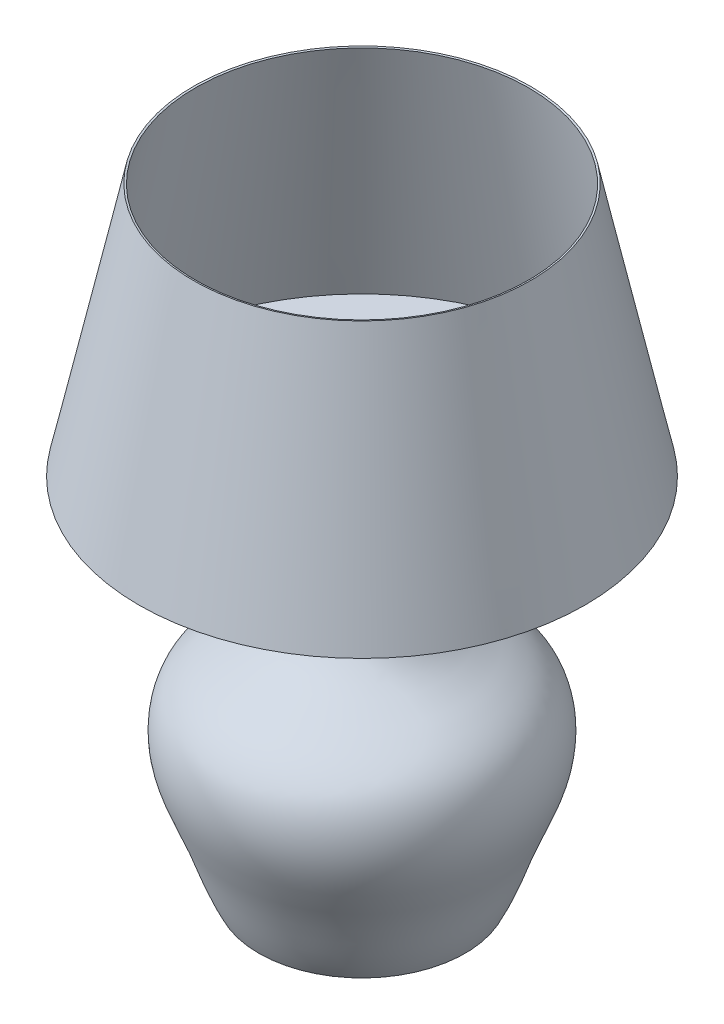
ISO-10303-21;
HEADER;
FILE_DESCRIPTION(('STEP AP214'),'2;1');
FILE_NAME('part.step','',(''),(''),'','','');
FILE_SCHEMA(('AUTOMOTIVE_DESIGN { 1 0 10303 214 1 1 1 1 }'));
ENDSEC;
DATA;
#1=APPLICATION_CONTEXT('core data for automotive mechanical design processes');
#2=APPLICATION_PROTOCOL_DEFINITION('international standard','automotive_design',2000,#1);
#3=PRODUCT_CONTEXT('',#1,'mechanical');
#4=PRODUCT('Part','Part','',(#3));
#5=PRODUCT_RELATED_PRODUCT_CATEGORY('part','',(#4));
#6=PRODUCT_DEFINITION_FORMATION('','',#4);
#7=PRODUCT_DEFINITION_CONTEXT('part definition',#1,'design');
#8=PRODUCT_DEFINITION('design','',#6,#7);
#9=PRODUCT_DEFINITION_SHAPE('','',#8);
#10=(LENGTH_UNIT() NAMED_UNIT(*) SI_UNIT(.MILLI.,.METRE.));
#11=(NAMED_UNIT(*) PLANE_ANGLE_UNIT() SI_UNIT($,.RADIAN.));
#12=(NAMED_UNIT(*) SI_UNIT($,.STERADIAN.) SOLID_ANGLE_UNIT());
#13=UNCERTAINTY_MEASURE_WITH_UNIT(LENGTH_MEASURE(1.E-05),#10,'distance_accuracy_value','');
#14=(GEOMETRIC_REPRESENTATION_CONTEXT(3) GLOBAL_UNCERTAINTY_ASSIGNED_CONTEXT((#13)) GLOBAL_UNIT_ASSIGNED_CONTEXT((#10,
#11,#12)) REPRESENTATION_CONTEXT('',''));
#15=CARTESIAN_POINT('',(0.,0.,0.));
#16=DIRECTION('',(0.,0.,1.));
#17=DIRECTION('',(1.,0.,0.));
#18=AXIS2_PLACEMENT_3D('',#15,#16,#17);
#19=CARTESIAN_POINT('',(1904.47065654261,1161.11269710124,0.));
#20=DIRECTION('',(0.,-1.,0.));
#21=DIRECTION('',(0.,0.,-1.));
#22=AXIS2_PLACEMENT_3D('',#19,#20,#21);
#23=CONICAL_SURFACE('',#22,352.288438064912,0.212134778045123);
#24=CARTESIAN_POINT('',(1904.47065654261,1562.2315660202,0.));
#25=DIRECTION('',(0.,-1.,0.));
#26=DIRECTION('',(0.,0.,-1.));
#27=AXIS2_PLACEMENT_3D('',#24,#25,#26);
#28=CIRCLE('',#27,265.897371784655);
#29=CARTESIAN_POINT('',(1904.47065654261,1562.2315660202,-265.897371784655));
#30=VERTEX_POINT('',#29);
#31=EDGE_CURVE('E10',#30,#30,#28,.T.);
#32=ORIENTED_EDGE('',*,*,#31,.F.);
#33=EDGE_LOOP('',(#32));
#34=FACE_BOUND('',#33,.T.);
#35=CARTESIAN_POINT('',(1904.47065654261,1161.11269710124,0.));
#36=DIRECTION('',(0.,-1.,0.));
#37=DIRECTION('',(0.,0.,-1.));
#38=AXIS2_PLACEMENT_3D('',#35,#36,#37);
#39=CIRCLE('',#38,352.288438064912);
#40=CARTESIAN_POINT('',(1904.47065654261,1161.11269710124,-352.288438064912));
#41=VERTEX_POINT('',#40);
#42=EDGE_CURVE('E71',#41,#41,#39,.T.);
#43=ORIENTED_EDGE('',*,*,#42,.T.);
#44=EDGE_LOOP('',(#43));
#45=FACE_BOUND('',#44,.T.);
#46=ADVANCED_FACE('F31',(#34,#45),#23,.F.);
#47=CARTESIAN_POINT('',(1904.47065654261,1562.86320792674,0.));
#48=DIRECTION('',(0.,1.,0.));
#49=DIRECTION('',(0.,0.,1.));
#50=AXIS2_PLACEMENT_3D('',#47,#48,#49);
#51=CONICAL_SURFACE('',#50,268.830122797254,1.35866154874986);
#52=ORIENTED_EDGE('',*,*,#31,.T.);
#53=EDGE_LOOP('',(#52));
#54=FACE_BOUND('',#53,.T.);
#55=CARTESIAN_POINT('',(1904.47065654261,1562.86320792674,0.));
#56=DIRECTION('',(0.,-1.,0.));
#57=DIRECTION('',(0.,0.,-1.));
#58=AXIS2_PLACEMENT_3D('',#55,#56,#57);
#59=CIRCLE('',#58,268.830122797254);
#60=CARTESIAN_POINT('',(1904.47065654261,1562.86320792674,-268.830122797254));
#61=VERTEX_POINT('',#60);
#62=EDGE_CURVE('E37',#61,#61,#59,.T.);
#63=ORIENTED_EDGE('',*,*,#62,.F.);
#64=EDGE_LOOP('',(#63));
#65=FACE_BOUND('',#64,.T.);
#66=ADVANCED_FACE('F118',(#54,#65),#51,.F.);
#67=CARTESIAN_POINT('',(1904.47065654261,1158.11269710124,0.));
#68=DIRECTION('',(0.,-1.,0.));
#69=DIRECTION('',(0.,0.,-1.));
#70=AXIS2_PLACEMENT_3D('',#67,#68,#69);
#71=CONICAL_SURFACE('',#70,356.003354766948,0.212134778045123);
#72=ORIENTED_EDGE('',*,*,#62,.T.);
#73=EDGE_LOOP('',(#72));
#74=FACE_BOUND('',#73,.T.);
#75=CARTESIAN_POINT('',(1904.47065654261,1158.11269710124,0.));
#76=DIRECTION('',(0.,-1.,0.));
#77=DIRECTION('',(0.,0.,-1.));
#78=AXIS2_PLACEMENT_3D('',#75,#76,#77);
#79=CIRCLE('',#78,356.003354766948);
#80=CARTESIAN_POINT('',(1904.47065654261,1158.11269710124,-356.003354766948));
#81=VERTEX_POINT('',#80);
#82=EDGE_CURVE('E41',#81,#81,#79,.T.);
#83=ORIENTED_EDGE('',*,*,#82,.F.);
#84=EDGE_LOOP('',(#83));
#85=FACE_BOUND('',#84,.T.);
#86=ADVANCED_FACE('F115',(#74,#85),#71,.T.);
#87=CARTESIAN_POINT('',(1893.77521626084,1158.11269710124,0.));
#88=DIRECTION('',(0.,-1.,0.));
#89=DIRECTION('',(0.,0.,-1.));
#90=AXIS2_PLACEMENT_3D('',#87,#88,#89);
#91=PLANE('',#90);
#92=ORIENTED_EDGE('',*,*,#82,.T.);
#93=EDGE_LOOP('',(#92));
#94=FACE_BOUND('',#93,.T.);
#95=CARTESIAN_POINT('',(1904.47065654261,1158.11269710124,0.));
#96=DIRECTION('',(0.,-1.,0.));
#97=DIRECTION('',(0.,0.,-1.));
#98=AXIS2_PLACEMENT_3D('',#95,#96,#97);
#99=CIRCLE('',#98,10.6954402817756);
#100=CARTESIAN_POINT('',(1904.47065654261,1158.11269710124,-10.6954402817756));
#101=VERTEX_POINT('',#100);
#102=EDGE_CURVE('E45',#101,#101,#99,.T.);
#103=ORIENTED_EDGE('',*,*,#102,.F.);
#104=EDGE_LOOP('',(#103));
#105=FACE_BOUND('',#104,.T.);
#106=ADVANCED_FACE('F111',(#94,#105),#91,.T.);
#107=CARTESIAN_POINT('',(1904.47065654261,581.201749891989,0.));
#108=DIRECTION('',(0.,-1.,0.));
#109=DIRECTION('',(0.,0.,-1.));
#110=AXIS2_PLACEMENT_3D('',#107,#108,#109);
#111=CYLINDRICAL_SURFACE('',#110,10.6954402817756);
#112=ORIENTED_EDGE('',*,*,#102,.T.);
#113=EDGE_LOOP('',(#112));
#114=FACE_BOUND('',#113,.T.);
#115=CARTESIAN_POINT('',(1904.47065654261,1092.24598826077,0.));
#116=DIRECTION('',(0.,-1.,0.));
#117=DIRECTION('',(0.,0.,-1.));
#118=AXIS2_PLACEMENT_3D('',#115,#116,#117);
#119=CIRCLE('',#118,10.6954402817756);
#120=CARTESIAN_POINT('',(1904.47065654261,1092.24598826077,-10.6954402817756));
#121=VERTEX_POINT('',#120);
#122=EDGE_CURVE('E50',#121,#121,#119,.T.);
#123=ORIENTED_EDGE('',*,*,#122,.F.);
#124=EDGE_LOOP('',(#123));
#125=FACE_BOUND('',#124,.T.);
#126=ADVANCED_FACE('F107',(#114,#125),#111,.T.);
#127=CARTESIAN_POINT('',(1847.92320108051,1092.24598826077,0.));
#128=DIRECTION('',(0.,1.,0.));
#129=DIRECTION('',(0.,0.,1.));
#130=AXIS2_PLACEMENT_3D('',#127,#128,#129);
#131=PLANE('',#130);
#132=ORIENTED_EDGE('',*,*,#122,.T.);
#133=EDGE_LOOP('',(#132));
#134=FACE_BOUND('',#133,.T.);
#135=CARTESIAN_POINT('',(1904.47065654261,1092.24598826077,0.));
#136=DIRECTION('',(0.,-1.,0.));
#137=DIRECTION('',(0.,0.,-1.));
#138=AXIS2_PLACEMENT_3D('',#135,#136,#137);
#139=CIRCLE('',#138,56.5474554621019);
#140=CARTESIAN_POINT('',(1904.47065654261,1092.24598826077,-56.5474554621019));
#141=VERTEX_POINT('',#140);
#142=EDGE_CURVE('E53',#141,#141,#139,.T.);
#143=ORIENTED_EDGE('',*,*,#142,.F.);
#144=EDGE_LOOP('',(#143));
#145=FACE_BOUND('',#144,.T.);
#146=ADVANCED_FACE('F103',(#134,#145),#131,.T.);
#147=CARTESIAN_POINT('',(1739.71244525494,581.201749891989,0.));
#148=CARTESIAN_POINT('',(1722.62554384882,613.666862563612,0.));
#149=CARTESIAN_POINT('',(1702.27779777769,686.565503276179,0.));
#150=CARTESIAN_POINT('',(1654.28801379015,779.058144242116,0.));
#151=CARTESIAN_POINT('',(1670.31860425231,876.16692086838,0.));
#152=CARTESIAN_POINT('',(1735.33271181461,919.989981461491,0.));
#153=CARTESIAN_POINT('',(1809.68777037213,954.3314538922,0.));
#154=CARTESIAN_POINT('',(1847.90443994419,1026.92924118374,0.));
#155=CARTESIAN_POINT('',(1847.71213818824,1077.01065544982,0.));
#156=CARTESIAN_POINT('',(1847.92320108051,1092.24598826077,0.));
#157=B_SPLINE_CURVE_WITH_KNOTS('',3,(#147,#148,#149,#150,#151,#152,#153,#154,#155,#156),
.UNSPECIFIED.,.F.,.F.,(4,1,1,1,1,1,1,4),(0.,0.183344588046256,0.378136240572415,
0.513085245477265,0.628440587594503,0.753013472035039,0.921603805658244,1.),.UNSPECIFIED.);
#158=CARTESIAN_POINT('',(1904.47065654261,581.201749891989,0.));
#159=DIRECTION('',(0.,-1.,0.));
#160=AXIS1_PLACEMENT('',#158,#159);
#161=SURFACE_OF_REVOLUTION('',#157,#160);
#162=ORIENTED_EDGE('',*,*,#142,.T.);
#163=EDGE_LOOP('',(#162));
#164=FACE_BOUND('',#163,.T.);
#165=CARTESIAN_POINT('',(1904.47065654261,581.201749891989,0.));
#166=DIRECTION('',(0.,-1.,0.));
#167=DIRECTION('',(0.,0.,-1.));
#168=AXIS2_PLACEMENT_3D('',#165,#166,#167);
#169=CIRCLE('',#168,164.758211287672);
#170=CARTESIAN_POINT('',(1904.47065654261,581.201749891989,-164.758211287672));
#171=VERTEX_POINT('',#170);
#172=EDGE_CURVE('E56',#171,#171,#169,.T.);
#173=ORIENTED_EDGE('',*,*,#172,.F.);
#174=EDGE_LOOP('',(#173));
#175=FACE_BOUND('',#174,.T.);
#176=ADVANCED_FACE('F99',(#164,#175),#161,.F.);
#177=CARTESIAN_POINT('',(1739.71244525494,581.201749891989,0.));
#178=DIRECTION('',(0.,-1.,0.));
#179=DIRECTION('',(0.,0.,-1.));
#180=AXIS2_PLACEMENT_3D('',#177,#178,#179);
#181=PLANE('',#180);
#182=ORIENTED_EDGE('',*,*,#172,.T.);
#183=EDGE_LOOP('',(#182));
#184=FACE_BOUND('',#183,.T.);
#185=ADVANCED_FACE('F95',(#184),#181,.T.);
#186=CARTESIAN_POINT('',(1739.71244525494,584.201749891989,0.));
#187=DIRECTION('',(0.,-1.,0.));
#188=DIRECTION('',(0.,0.,-1.));
#189=AXIS2_PLACEMENT_3D('',#186,#187,#188);
#190=PLANE('',#189);
#191=CARTESIAN_POINT('',(1904.47065654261,584.201749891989,0.));
#192=DIRECTION('',(0.,-1.,0.));
#193=DIRECTION('',(0.,0.,-1.));
#194=AXIS2_PLACEMENT_3D('',#191,#192,#193);
#195=CIRCLE('',#194,162.939914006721);
#196=CARTESIAN_POINT('',(1904.47065654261,584.201749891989,-162.939914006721));
#197=VERTEX_POINT('',#196);
#198=EDGE_CURVE('E59',#197,#197,#195,.T.);
#199=ORIENTED_EDGE('',*,*,#198,.F.);
#200=EDGE_LOOP('',(#199));
#201=FACE_BOUND('',#200,.T.);
#202=ADVANCED_FACE('F90',(#201),#190,.F.);
#203=CARTESIAN_POINT('',(1741.53074253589,584.201749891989,0.));
#204=CARTESIAN_POINT('',(1735.89744285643,595.08725749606,0.));
#205=CARTESIAN_POINT('',(1731.04534573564,606.320809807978,0.));
#206=CARTESIAN_POINT('',(1722.09001997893,629.189631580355,0.));
#207=CARTESIAN_POINT('',(1717.9870804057,640.824457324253,0.));
#208=CARTESIAN_POINT('',(1711.77641039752,658.347167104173,0.));
#209=CARTESIAN_POINT('',(1709.69669816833,664.199766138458,0.));
#210=CARTESIAN_POINT('',(1706.48458736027,672.967060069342,0.));
#211=CARTESIAN_POINT('',(1705.3984529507,675.887554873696,0.));
#212=CARTESIAN_POINT('',(1703.18219051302,681.719775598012,0.));
#213=CARTESIAN_POINT('',(1702.05002833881,684.632707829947,0.));
#214=CARTESIAN_POINT('',(1696.27459963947,699.142223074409,0.));
#215=CARTESIAN_POINT('',(1691.32480303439,710.591771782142,0.));
#216=CARTESIAN_POINT('',(1681.98643086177,733.537890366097,0.));
#217=CARTESIAN_POINT('',(1677.59815878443,745.033846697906,0.));
#218=CARTESIAN_POINT('',(1670.57396695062,768.423275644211,0.));
#219=CARTESIAN_POINT('',(1667.93755545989,780.314507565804,0.));
#220=CARTESIAN_POINT('',(1666.46006239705,795.66415968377,0.));
#221=CARTESIAN_POINT('',(1666.25599894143,798.761553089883,0.));
#222=CARTESIAN_POINT('',(1666.03993284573,804.989521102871,0.));
#223=CARTESIAN_POINT('',(1666.02782579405,808.118913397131,0.));
#224=CARTESIAN_POINT('',(1666.29164412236,817.508935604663,0.));
#225=CARTESIAN_POINT('',(1666.86787162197,823.77134418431,0.));
#226=CARTESIAN_POINT('',(1668.88328834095,836.065404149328,0.));
#227=CARTESIAN_POINT('',(1670.32248829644,842.096926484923,0.));
#228=CARTESIAN_POINT('',(1674.1207152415,853.697152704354,0.));
#229=CARTESIAN_POINT('',(1676.4795975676,859.265604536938,0.));
#230=CARTESIAN_POINT('',(1680.7473350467,867.104076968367,0.));
#231=CARTESIAN_POINT('',(1682.29073230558,869.629859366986,0.));
#232=CARTESIAN_POINT('',(1685.63071709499,874.490142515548,0.));
#233=CARTESIAN_POINT('',(1687.42969376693,876.831826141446,0.));
#234=CARTESIAN_POINT('',(1693.1703919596,883.616917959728,0.));
#235=CARTESIAN_POINT('',(1697.45651607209,887.820520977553,0.));
#236=CARTESIAN_POINT('',(1711.32436089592,899.656320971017,0.));
#237=CARTESIAN_POINT('',(1721.91682741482,906.508777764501,0.));
#238=CARTESIAN_POINT('',(1738.25336398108,915.983966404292,0.));
#239=CARTESIAN_POINT('',(1743.76671159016,919.00327161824,0.));
#240=CARTESIAN_POINT('',(1754.78015670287,925.001649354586,0.));
#241=CARTESIAN_POINT('',(1760.28118420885,927.98173901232,0.));
#242=CARTESIAN_POINT('',(1771.12594260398,934.153861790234,0.));
#243=CARTESIAN_POINT('',(1776.46980659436,937.345953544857,0.));
#244=CARTESIAN_POINT('',(1786.8498298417,944.197599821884,0.));
#245=CARTESIAN_POINT('',(1791.88617035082,947.857417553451,0.));
#246=CARTESIAN_POINT('',(1799.08976176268,953.890210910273,0.));
#247=CARTESIAN_POINT('',(1801.43180485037,955.995523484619,0.));
#248=CARTESIAN_POINT('',(1805.97166314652,960.381923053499,0.));
#249=CARTESIAN_POINT('',(1808.17184740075,962.662284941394,0.));
#250=CARTESIAN_POINT('',(1814.55406213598,969.741185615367,0.));
#251=CARTESIAN_POINT('',(1818.51778641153,974.777473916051,0.));
#252=CARTESIAN_POINT('',(1829.46226654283,990.650901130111,0.));
#253=CARTESIAN_POINT('',(1835.49713833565,1002.2521632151,0.));
#254=CARTESIAN_POINT('',(1842.35210626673,1020.45046930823,0.));
#255=CARTESIAN_POINT('',(1844.27069023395,1026.64945243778,0.));
#256=CARTESIAN_POINT('',(1846.55894807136,1036.05649787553,0.));
#257=CARTESIAN_POINT('',(1847.2234168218,1039.21027723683,0.));
#258=CARTESIAN_POINT('',(1848.34893696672,1045.53890526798,0.));
#259=CARTESIAN_POINT('',(1848.80597423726,1048.7125499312,0.));
#260=CARTESIAN_POINT('',(1849.91093967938,1058.21277840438,0.));
#261=CARTESIAN_POINT('',(1850.30027962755,1064.52870762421,0.));
#262=CARTESIAN_POINT('',(1850.75004899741,1077.01955860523,0.));
#263=CARTESIAN_POINT('',(1850.81048793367,1083.19473887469,0.));
#264=CARTESIAN_POINT('',(1850.88467819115,1089.24598826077,0.));
#265=B_SPLINE_CURVE_WITH_KNOTS('',3,(#203,#204,#205,#206,#207,#208,#209,#210,#211,#212,#213,
#214,#215,#216,#217,#218,#219,#220,#221,#222,#223,#224,#225,#226,#227,#228,#229,#230,#231,#232,
#233,#234,#235,#236,#237,#238,#239,#240,#241,#242,#243,#244,#245,#246,#247,#248,#249,#250,#251,
#252,#253,#254,#255,#256,#257,#258,#259,#260,#261,#262,#263,#264),.UNSPECIFIED.,.F.,.F.,(4,2,2,
2,2,2,2,2,2,2,2,2,2,2,2,2,2,2,2,2,2,2,2,2,2,2,2,2,2,2,4),(0.,0.0624999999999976,
0.124999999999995,0.156249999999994,0.171874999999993,0.187499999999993,0.249999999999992,
0.312499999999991,0.37499999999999,0.39062499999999,0.406249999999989,0.437499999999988,
0.468749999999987,0.499999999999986,0.515624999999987,0.531249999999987,0.562499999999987,
0.624999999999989,0.65624999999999,0.687499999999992,0.718749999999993,0.749999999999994,
0.765624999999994,0.781249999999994,0.812499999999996,0.874999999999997,0.906249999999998,
0.921874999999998,0.937499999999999,0.968749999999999,1.),.UNSPECIFIED.);
#266=CARTESIAN_POINT('',(1904.47065654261,581.201749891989,0.));
#267=DIRECTION('',(0.,-1.,0.));
#268=AXIS1_PLACEMENT('',#266,#267);
#269=SURFACE_OF_REVOLUTION('',#265,#268);
#270=CARTESIAN_POINT('',(1904.47065654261,1089.24598826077,0.));
#271=DIRECTION('',(0.,-1.,0.));
#272=DIRECTION('',(0.,0.,-1.));
#273=AXIS2_PLACEMENT_3D('',#270,#271,#272);
#274=CIRCLE('',#273,53.5859783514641);
#275=CARTESIAN_POINT('',(1904.47065654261,1089.24598826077,-53.5859783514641));
#276=VERTEX_POINT('',#275);
#277=EDGE_CURVE('E62',#276,#276,#274,.T.);
#278=ORIENTED_EDGE('',*,*,#277,.F.);
#279=EDGE_LOOP('',(#278));
#280=FACE_BOUND('',#279,.T.);
#281=ORIENTED_EDGE('',*,*,#198,.T.);
#282=EDGE_LOOP('',(#281));
#283=FACE_BOUND('',#282,.T.);
#284=ADVANCED_FACE('F85',(#280,#283),#269,.T.);
#285=CARTESIAN_POINT('',(1847.92320108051,1089.24598826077,0.));
#286=DIRECTION('',(0.,1.,0.));
#287=DIRECTION('',(0.,0.,1.));
#288=AXIS2_PLACEMENT_3D('',#285,#286,#287);
#289=PLANE('',#288);
#290=CARTESIAN_POINT('',(1904.47065654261,1089.24598826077,0.));
#291=DIRECTION('',(0.,-1.,0.));
#292=DIRECTION('',(0.,0.,-1.));
#293=AXIS2_PLACEMENT_3D('',#290,#291,#292);
#294=CIRCLE('',#293,7.69544028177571);
#295=CARTESIAN_POINT('',(1904.47065654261,1089.24598826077,-7.69544028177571));
#296=VERTEX_POINT('',#295);
#297=EDGE_CURVE('E65',#296,#296,#294,.T.);
#298=ORIENTED_EDGE('',*,*,#297,.F.);
#299=EDGE_LOOP('',(#298));
#300=FACE_BOUND('',#299,.T.);
#301=ORIENTED_EDGE('',*,*,#277,.T.);
#302=EDGE_LOOP('',(#301));
#303=FACE_BOUND('',#302,.T.);
#304=ADVANCED_FACE('F89',(#300,#303),#289,.F.);
#305=CARTESIAN_POINT('',(1904.47065654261,581.201749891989,0.));
#306=DIRECTION('',(0.,-1.,0.));
#307=DIRECTION('',(0.,0.,-1.));
#308=AXIS2_PLACEMENT_3D('',#305,#306,#307);
#309=CYLINDRICAL_SURFACE('',#308,7.69544028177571);
#310=CARTESIAN_POINT('',(1904.47065654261,1161.11269710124,0.));
#311=DIRECTION('',(0.,-1.,0.));
#312=DIRECTION('',(0.,0.,-1.));
#313=AXIS2_PLACEMENT_3D('',#310,#311,#312);
#314=CIRCLE('',#313,7.69544028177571);
#315=CARTESIAN_POINT('',(1904.47065654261,1161.11269710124,-7.69544028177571));
#316=VERTEX_POINT('',#315);
#317=EDGE_CURVE('E68',#316,#316,#314,.T.);
#318=ORIENTED_EDGE('',*,*,#317,.F.);
#319=EDGE_LOOP('',(#318));
#320=FACE_BOUND('',#319,.T.);
#321=ORIENTED_EDGE('',*,*,#297,.T.);
#322=EDGE_LOOP('',(#321));
#323=FACE_BOUND('',#322,.T.);
#324=ADVANCED_FACE('F133',(#320,#323),#309,.F.);
#325=CARTESIAN_POINT('',(1893.77521626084,1161.11269710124,0.));
#326=DIRECTION('',(0.,-1.,0.));
#327=DIRECTION('',(0.,0.,-1.));
#328=AXIS2_PLACEMENT_3D('',#325,#326,#327);
#329=PLANE('',#328);
#330=ORIENTED_EDGE('',*,*,#42,.F.);
#331=EDGE_LOOP('',(#330));
#332=FACE_BOUND('',#331,.T.);
#333=ORIENTED_EDGE('',*,*,#317,.T.);
#334=EDGE_LOOP('',(#333));
#335=FACE_BOUND('',#334,.T.);
#336=ADVANCED_FACE('F130',(#332,#335),#329,.F.);
#337=CLOSED_SHELL('',(#46,#66,#86,#106,#126,#146,#176,#185,#202,#284,#304,#324,#336));
#338=MANIFOLD_SOLID_BREP('B2',#337);
#339=ADVANCED_BREP_SHAPE_REPRESENTATION('',(#18,#338),#14);
#340=SHAPE_DEFINITION_REPRESENTATION(#9,#339);
ENDSEC;
END-ISO-10303-21;
